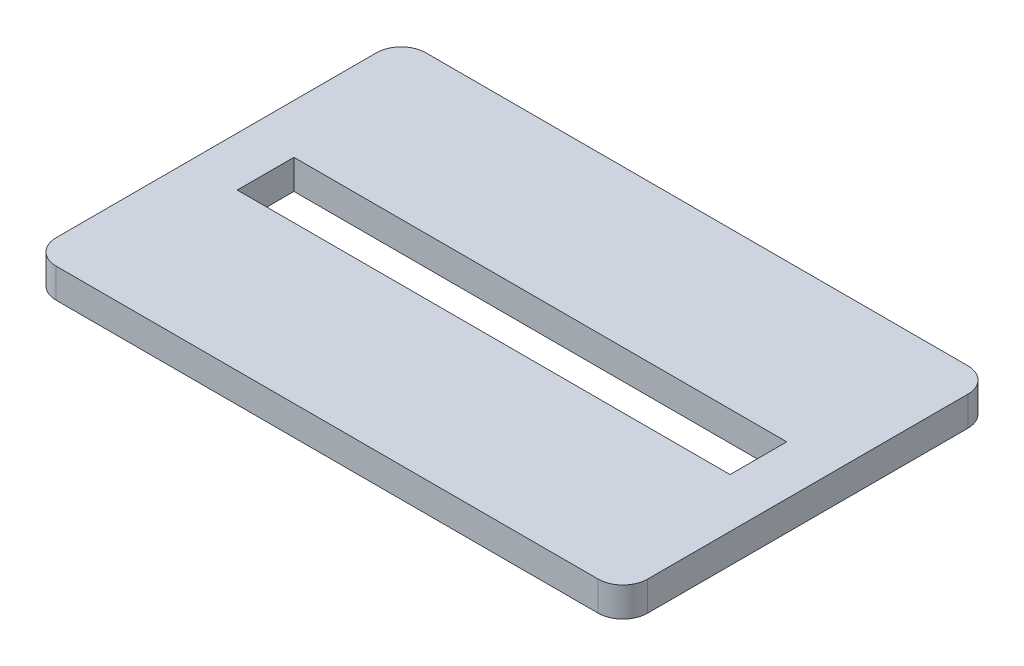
from build123d import *

# Parameters (mm, degrees)
SKETCH1_W           = 120
SKETCH1_H           = 75
SKETCH1_W_2         = 100
SKETCH1_H_2         = 11.5
BOSS_EXTRUDE1_DEPTH = 6
FILLET1_R           = 5


with BuildPart() as part:
    # Sketch1 → Boss-Extrude1 (new body)
    with BuildSketch(Plane(origin=(0, 0, 0), x_dir=(1, 0, 0), z_dir=(0, 1, 0))):
        Rectangle(SKETCH1_W, SKETCH1_H)
        Rectangle(SKETCH1_W_2, SKETCH1_H_2, mode=Mode.SUBTRACT)
    extrude(amount=BOSS_EXTRUDE1_DEPTH)

    # Fillet1
    fillet1_edges = [part.edges().sort_by_distance(p)[0] for p in [
        (60, 3, 37.5),
        (-60, 3, 37.5),
        (-60, 3, -37.5),
        (60, 3, -37.5),
    ]]
    fillet(fillet1_edges, radius=FILLET1_R)


solid = part.part
